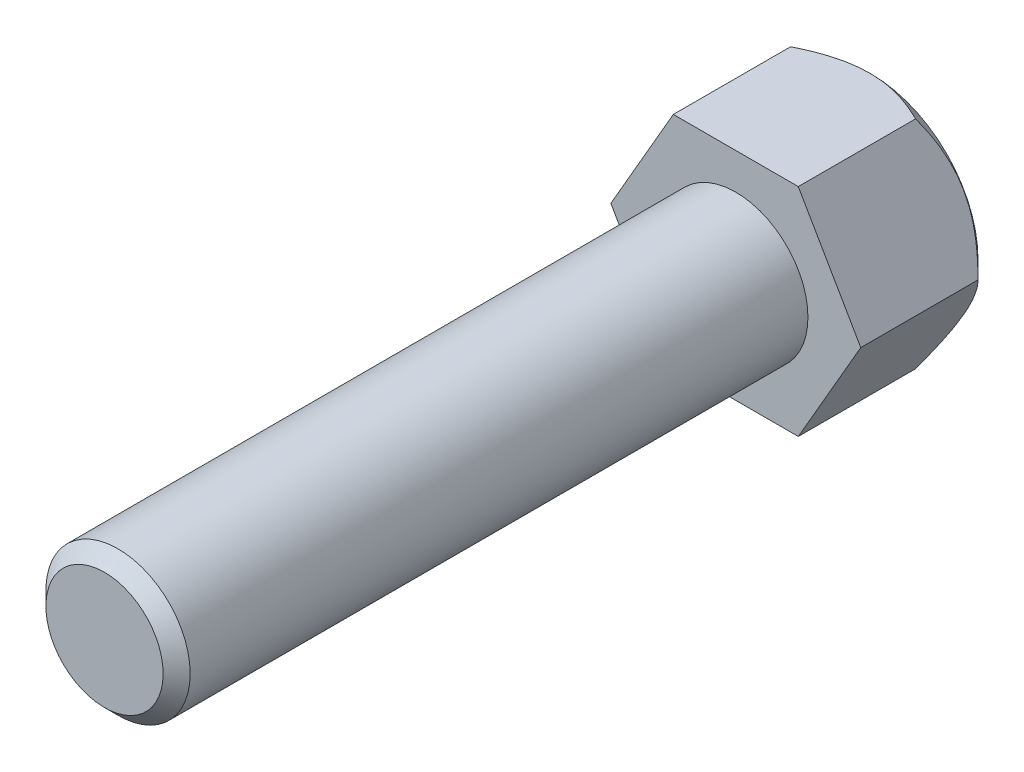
from build123d import *

# Parameters (mm, degrees)
BOSS_EXTRU_1_DEPTH = 15
ESQUISSE2_R        = 8
BOSS_EXTRU_2_DEPTH = 70
CHANFREIN1_SIZE    = 1.5


with BuildPart() as part:
    # Esquisse1 → Boss.-Extru.1 (new body)
    with BuildSketch(Plane.XY):
        Polygon((13.856406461, 0), (6.92820323, 12), (-6.92820323, 12), (-13.856406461, 0), (-6.92820323, -12), (6.92820323, -12), align=None)
    extrude(amount=BOSS_EXTRU_1_DEPTH)

    # Esquisse2 → Boss.-Extru.2 (add)
    with BuildSketch(Plane.XY.offset(15)):
        Circle(ESQUISSE2_R)
    extrude(amount=BOSS_EXTRU_2_DEPTH)

    # Chanfrein1
    chanfrein1_edges = [part.edges().sort_by_distance(p)[0] for p in [
        (-8, 0, 85),
    ]]
    chamfer(chanfrein1_edges, length=CHANFREIN1_SIZE)

    # Esquisse3 → Enl_vement de mati_re-R_volution1 (revolve, cut)
    with BuildSketch(Plane(origin=(0, 0, 0), x_dir=(1, 0, 0), z_dir=(0, 1, 0)), mode=Mode.PRIVATE) as enl_vement_de_mati_re_r_volution1_sk:
        Polygon((13.856406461, 0), (11.856406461, 0), (13.856406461, -2), align=None)
    revolve(enl_vement_de_mati_re_r_volution1_sk.sketch.rotate(Axis((0, 0, 0), (0, 0, 1)), 180), axis=Axis((0, 0, 0), (0, 0, 1)), mode=Mode.SUBTRACT)


solid = part.part
